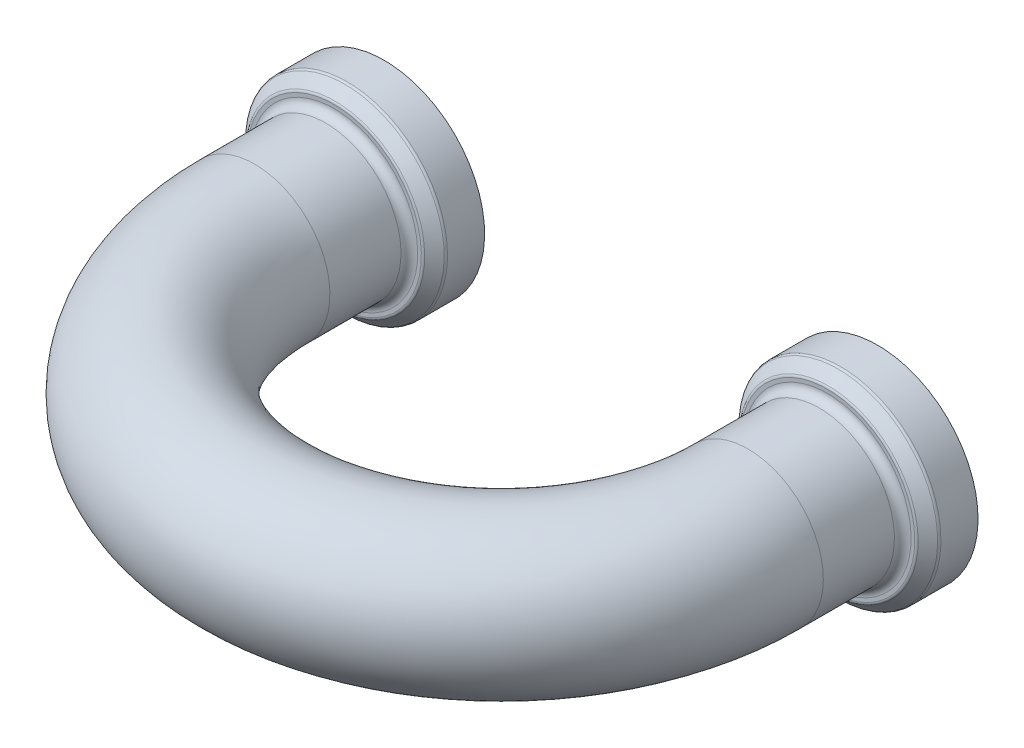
ISO-10303-21;
HEADER;
FILE_DESCRIPTION(('STEP AP214'),'2;1');
FILE_NAME('part.step','',(''),(''),'','','');
FILE_SCHEMA(('AUTOMOTIVE_DESIGN { 1 0 10303 214 1 1 1 1 }'));
ENDSEC;
DATA;
#1=APPLICATION_CONTEXT('core data for automotive mechanical design processes');
#2=APPLICATION_PROTOCOL_DEFINITION('international standard','automotive_design',2000,#1);
#3=PRODUCT_CONTEXT('',#1,'mechanical');
#4=PRODUCT('Part','Part','',(#3));
#5=PRODUCT_RELATED_PRODUCT_CATEGORY('part','',(#4));
#6=PRODUCT_DEFINITION_FORMATION('','',#4);
#7=PRODUCT_DEFINITION_CONTEXT('part definition',#1,'design');
#8=PRODUCT_DEFINITION('design','',#6,#7);
#9=PRODUCT_DEFINITION_SHAPE('','',#8);
#10=(LENGTH_UNIT() NAMED_UNIT(*) SI_UNIT(.MILLI.,.METRE.));
#11=(NAMED_UNIT(*) PLANE_ANGLE_UNIT() SI_UNIT($,.RADIAN.));
#12=(NAMED_UNIT(*) SI_UNIT($,.STERADIAN.) SOLID_ANGLE_UNIT());
#13=UNCERTAINTY_MEASURE_WITH_UNIT(LENGTH_MEASURE(1.E-05),#10,'distance_accuracy_value','');
#14=(GEOMETRIC_REPRESENTATION_CONTEXT(3) GLOBAL_UNCERTAINTY_ASSIGNED_CONTEXT((#13)) GLOBAL_UNIT_ASSIGNED_CONTEXT((#10,
#11,#12)) REPRESENTATION_CONTEXT('',''));
#15=CARTESIAN_POINT('',(0.,0.,0.));
#16=DIRECTION('',(0.,0.,1.));
#17=DIRECTION('',(1.,0.,0.));
#18=AXIS2_PLACEMENT_3D('',#15,#16,#17);
#19=CARTESIAN_POINT('',(14.75,0.,7.75));
#20=DIRECTION('',(0.,1.,0.));
#21=DIRECTION('',(-1.,0.,0.));
#22=AXIS2_PLACEMENT_3D('',#19,#20,#21);
#23=TOROIDAL_SURFACE('',#22,14.75,4.5);
#24=CARTESIAN_POINT('',(0.,0.,7.75));
#25=DIRECTION('',(0.,0.,1.));
#26=DIRECTION('',(0.,1.,0.));
#27=AXIS2_PLACEMENT_3D('',#24,#25,#26);
#28=CIRCLE('',#27,4.5);
#29=CARTESIAN_POINT('',(-4.5,0.,7.75));
#30=VERTEX_POINT('',#29);
#31=EDGE_CURVE('E22',#30,#30,#28,.T.);
#32=CARTESIAN_POINT('',(29.5,0.,7.75));
#33=DIRECTION('',(0.,0.,-1.));
#34=DIRECTION('',(0.,1.,0.));
#35=AXIS2_PLACEMENT_3D('',#32,#33,#34);
#36=CIRCLE('',#35,4.5);
#37=CARTESIAN_POINT('',(34.,0.,7.75));
#38=VERTEX_POINT('',#37);
#39=EDGE_CURVE('E26',#38,#38,#36,.T.);
#40=CARTESIAN_POINT('',(14.75,0.,7.75));
#41=DIRECTION('',(0.,1.,0.));
#42=DIRECTION('',(-1.,0.,0.));
#43=AXIS2_PLACEMENT_3D('',#40,#41,#42);
#44=CIRCLE('',#43,19.25);
#45=EDGE_CURVE('',#30,#38,#44,.T.);
#46=ORIENTED_EDGE('',*,*,#31,.T.);
#47=ORIENTED_EDGE('',*,*,#39,.F.);
#48=ORIENTED_EDGE('',*,*,#45,.T.);
#49=ORIENTED_EDGE('',*,*,#45,.F.);
#50=EDGE_LOOP('',(#46,#48,#47,#49));
#51=FACE_BOUND('',#50,.T.);
#52=ADVANCED_FACE('F12',(#51),#23,.T.);
#53=CARTESIAN_POINT('',(0.,0.,0.));
#54=DIRECTION('',(0.,0.,1.));
#55=DIRECTION('',(0.,-1.,0.));
#56=AXIS2_PLACEMENT_3D('',#53,#54,#55);
#57=PLANE('',#56);
#58=CARTESIAN_POINT('',(0.,0.,0.));
#59=DIRECTION('',(0.,0.,1.));
#60=DIRECTION('',(0.,-1.,0.));
#61=AXIS2_PLACEMENT_3D('',#58,#59,#60);
#62=CIRCLE('',#61,6.);
#63=CARTESIAN_POINT('',(0.,-6.,0.));
#64=VERTEX_POINT('',#63);
#65=EDGE_CURVE('E31',#64,#64,#62,.T.);
#66=ORIENTED_EDGE('',*,*,#65,.F.);
#67=EDGE_LOOP('',(#66));
#68=FACE_BOUND('',#67,.T.);
#69=CARTESIAN_POINT('',(0.,0.,0.));
#70=DIRECTION('',(0.,0.,1.));
#71=DIRECTION('',(0.,-1.,0.));
#72=AXIS2_PLACEMENT_3D('',#69,#70,#71);
#73=CIRCLE('',#72,1.75);
#74=CARTESIAN_POINT('',(0.,-1.75,0.));
#75=VERTEX_POINT('',#74);
#76=EDGE_CURVE('E18',#75,#75,#73,.F.);
#77=ORIENTED_EDGE('',*,*,#76,.F.);
#78=EDGE_LOOP('',(#77));
#79=FACE_BOUND('',#78,.T.);
#80=ADVANCED_FACE('F92',(#68,#79),#57,.F.);
#81=CARTESIAN_POINT('',(0.,0.,7.75));
#82=DIRECTION('',(0.,0.,1.));
#83=DIRECTION('',(0.,-1.,0.));
#84=AXIS2_PLACEMENT_3D('',#81,#82,#83);
#85=CYLINDRICAL_SURFACE('',#84,6.);
#86=CARTESIAN_POINT('',(0.,0.,2.21715728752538));
#87=DIRECTION('',(0.,0.,1.));
#88=DIRECTION('',(0.,-1.,0.));
#89=AXIS2_PLACEMENT_3D('',#86,#87,#88);
#90=CIRCLE('',#89,6.);
#91=CARTESIAN_POINT('',(0.,-6.,2.21715728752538));
#92=VERTEX_POINT('',#91);
#93=EDGE_CURVE('E34',#92,#92,#90,.T.);
#94=ORIENTED_EDGE('',*,*,#93,.F.);
#95=EDGE_LOOP('',(#94));
#96=FACE_BOUND('',#95,.T.);
#97=ORIENTED_EDGE('',*,*,#65,.T.);
#98=EDGE_LOOP('',(#97));
#99=FACE_BOUND('',#98,.T.);
#100=ADVANCED_FACE('F97',(#96,#99),#85,.T.);
#101=CARTESIAN_POINT('',(0.,0.,2.21715728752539));
#102=DIRECTION('',(0.,0.,1.));
#103=DIRECTION('',(0.,-1.,0.));
#104=AXIS2_PLACEMENT_3D('',#101,#102,#103);
#105=TOROIDAL_SURFACE('',#104,5.8,0.199999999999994);
#106=ORIENTED_EDGE('',*,*,#93,.T.);
#107=EDGE_LOOP('',(#106));
#108=FACE_BOUND('',#107,.T.);
#109=CARTESIAN_POINT('',(0.,0.,2.35857864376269));
#110=DIRECTION('',(0.,0.,1.));
#111=DIRECTION('',(0.,-1.,0.));
#112=AXIS2_PLACEMENT_3D('',#109,#110,#111);
#113=CIRCLE('',#112,5.94142135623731);
#114=CARTESIAN_POINT('',(0.,-5.94142135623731,2.35857864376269));
#115=VERTEX_POINT('',#114);
#116=EDGE_CURVE('E37',#115,#115,#113,.T.);
#117=ORIENTED_EDGE('',*,*,#116,.F.);
#118=EDGE_LOOP('',(#117));
#119=FACE_BOUND('',#118,.T.);
#120=ADVANCED_FACE('F164',(#108,#119),#105,.T.);
#121=CARTESIAN_POINT('',(0.,0.,2.35857864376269));
#122=DIRECTION('',(0.,0.,-1.));
#123=DIRECTION('',(0.,1.,0.));
#124=AXIS2_PLACEMENT_3D('',#121,#122,#123);
#125=CONICAL_SURFACE('',#124,5.94142135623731,0.785398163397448);
#126=CARTESIAN_POINT('',(0.,0.,2.94142135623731));
#127=DIRECTION('',(0.,0.,1.));
#128=DIRECTION('',(0.,-1.,0.));
#129=AXIS2_PLACEMENT_3D('',#126,#127,#128);
#130=CIRCLE('',#129,5.35857864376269);
#131=CARTESIAN_POINT('',(0.,-5.35857864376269,2.94142135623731));
#132=VERTEX_POINT('',#131);
#133=EDGE_CURVE('E40',#132,#132,#130,.T.);
#134=ORIENTED_EDGE('',*,*,#133,.F.);
#135=EDGE_LOOP('',(#134));
#136=FACE_BOUND('',#135,.T.);
#137=ORIENTED_EDGE('',*,*,#116,.T.);
#138=EDGE_LOOP('',(#137));
#139=FACE_BOUND('',#138,.T.);
#140=ADVANCED_FACE('F160',(#136,#139),#125,.T.);
#141=CARTESIAN_POINT('',(0.,0.,2.8));
#142=DIRECTION('',(0.,0.,1.));
#143=DIRECTION('',(0.,-1.,0.));
#144=AXIS2_PLACEMENT_3D('',#141,#142,#143);
#145=TOROIDAL_SURFACE('',#144,5.21715728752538,0.199999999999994);
#146=ORIENTED_EDGE('',*,*,#133,.T.);
#147=EDGE_LOOP('',(#146));
#148=FACE_BOUND('',#147,.T.);
#149=CARTESIAN_POINT('',(0.,0.,3.));
#150=DIRECTION('',(0.,0.,1.));
#151=DIRECTION('',(0.,-1.,0.));
#152=AXIS2_PLACEMENT_3D('',#149,#150,#151);
#153=CIRCLE('',#152,5.21715728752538);
#154=CARTESIAN_POINT('',(0.,-5.21715728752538,3.));
#155=VERTEX_POINT('',#154);
#156=EDGE_CURVE('E43',#155,#155,#153,.T.);
#157=ORIENTED_EDGE('',*,*,#156,.F.);
#158=EDGE_LOOP('',(#157));
#159=FACE_BOUND('',#158,.T.);
#160=ADVANCED_FACE('F156',(#148,#159),#145,.T.);
#161=CARTESIAN_POINT('',(-5.21715728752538,0.,3.));
#162=DIRECTION('',(0.,0.,-1.));
#163=DIRECTION('',(0.,1.,0.));
#164=AXIS2_PLACEMENT_3D('',#161,#162,#163);
#165=PLANE('',#164);
#166=CARTESIAN_POINT('',(0.,0.,3.));
#167=DIRECTION('',(0.,0.,1.));
#168=DIRECTION('',(0.,-1.,0.));
#169=AXIS2_PLACEMENT_3D('',#166,#167,#168);
#170=CIRCLE('',#169,5.);
#171=CARTESIAN_POINT('',(0.,-5.,3.));
#172=VERTEX_POINT('',#171);
#173=EDGE_CURVE('E46',#172,#172,#170,.T.);
#174=ORIENTED_EDGE('',*,*,#173,.F.);
#175=EDGE_LOOP('',(#174));
#176=FACE_BOUND('',#175,.T.);
#177=ORIENTED_EDGE('',*,*,#156,.T.);
#178=EDGE_LOOP('',(#177));
#179=FACE_BOUND('',#178,.T.);
#180=ADVANCED_FACE('F152',(#176,#179),#165,.F.);
#181=CARTESIAN_POINT('',(0.,0.,3.5));
#182=DIRECTION('',(0.,0.,1.));
#183=DIRECTION('',(0.,-1.,0.));
#184=AXIS2_PLACEMENT_3D('',#181,#182,#183);
#185=TOROIDAL_SURFACE('',#184,5.,0.5);
#186=CARTESIAN_POINT('',(0.,0.,3.5));
#187=DIRECTION('',(0.,0.,1.));
#188=DIRECTION('',(0.,-1.,0.));
#189=AXIS2_PLACEMENT_3D('',#186,#187,#188);
#190=CIRCLE('',#189,4.5);
#191=CARTESIAN_POINT('',(0.,-4.5,3.5));
#192=VERTEX_POINT('',#191);
#193=EDGE_CURVE('E49',#192,#192,#190,.T.);
#194=ORIENTED_EDGE('',*,*,#193,.F.);
#195=EDGE_LOOP('',(#194));
#196=FACE_BOUND('',#195,.T.);
#197=ORIENTED_EDGE('',*,*,#173,.T.);
#198=EDGE_LOOP('',(#197));
#199=FACE_BOUND('',#198,.T.);
#200=ADVANCED_FACE('F148',(#196,#199),#185,.F.);
#201=CARTESIAN_POINT('',(0.,0.,7.75));
#202=DIRECTION('',(0.,0.,1.));
#203=DIRECTION('',(0.,-1.,0.));
#204=AXIS2_PLACEMENT_3D('',#201,#202,#203);
#205=CYLINDRICAL_SURFACE('',#204,4.5);
#206=ORIENTED_EDGE('',*,*,#31,.F.);
#207=EDGE_LOOP('',(#206));
#208=FACE_BOUND('',#207,.T.);
#209=ORIENTED_EDGE('',*,*,#193,.T.);
#210=EDGE_LOOP('',(#209));
#211=FACE_BOUND('',#210,.T.);
#212=ADVANCED_FACE('F144',(#208,#211),#205,.T.);
#213=CARTESIAN_POINT('',(29.5,0.,0.));
#214=DIRECTION('',(0.,0.,1.));
#215=DIRECTION('',(0.,-1.,0.));
#216=AXIS2_PLACEMENT_3D('',#213,#214,#215);
#217=PLANE('',#216);
#218=CARTESIAN_POINT('',(29.5,0.,0.));
#219=DIRECTION('',(0.,0.,1.));
#220=DIRECTION('',(0.,-1.,0.));
#221=AXIS2_PLACEMENT_3D('',#218,#219,#220);
#222=CIRCLE('',#221,6.);
#223=CARTESIAN_POINT('',(29.5,-6.,0.));
#224=VERTEX_POINT('',#223);
#225=EDGE_CURVE('E52',#224,#224,#222,.T.);
#226=ORIENTED_EDGE('',*,*,#225,.F.);
#227=EDGE_LOOP('',(#226));
#228=FACE_BOUND('',#227,.T.);
#229=CARTESIAN_POINT('',(29.5,0.,0.));
#230=DIRECTION('',(0.,0.,1.));
#231=DIRECTION('',(0.,-1.,0.));
#232=AXIS2_PLACEMENT_3D('',#229,#230,#231);
#233=CIRCLE('',#232,1.75);
#234=CARTESIAN_POINT('',(29.5,-1.75,0.));
#235=VERTEX_POINT('',#234);
#236=EDGE_CURVE('E8',#235,#235,#233,.F.);
#237=ORIENTED_EDGE('',*,*,#236,.F.);
#238=EDGE_LOOP('',(#237));
#239=FACE_BOUND('',#238,.T.);
#240=ADVANCED_FACE('F140',(#228,#239),#217,.F.);
#241=CARTESIAN_POINT('',(29.5,0.,7.75));
#242=DIRECTION('',(0.,0.,1.));
#243=DIRECTION('',(0.,-1.,0.));
#244=AXIS2_PLACEMENT_3D('',#241,#242,#243);
#245=CYLINDRICAL_SURFACE('',#244,6.);
#246=CARTESIAN_POINT('',(29.5,0.,2.21715728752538));
#247=DIRECTION('',(0.,0.,1.));
#248=DIRECTION('',(0.,-1.,0.));
#249=AXIS2_PLACEMENT_3D('',#246,#247,#248);
#250=CIRCLE('',#249,6.);
#251=CARTESIAN_POINT('',(29.5,-6.,2.21715728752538));
#252=VERTEX_POINT('',#251);
#253=EDGE_CURVE('E55',#252,#252,#250,.T.);
#254=ORIENTED_EDGE('',*,*,#253,.F.);
#255=EDGE_LOOP('',(#254));
#256=FACE_BOUND('',#255,.T.);
#257=ORIENTED_EDGE('',*,*,#225,.T.);
#258=EDGE_LOOP('',(#257));
#259=FACE_BOUND('',#258,.T.);
#260=ADVANCED_FACE('F136',(#256,#259),#245,.T.);
#261=CARTESIAN_POINT('',(29.5,0.,2.21715728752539));
#262=DIRECTION('',(0.,0.,1.));
#263=DIRECTION('',(0.,-1.,0.));
#264=AXIS2_PLACEMENT_3D('',#261,#262,#263);
#265=TOROIDAL_SURFACE('',#264,5.8,0.199999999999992);
#266=ORIENTED_EDGE('',*,*,#253,.T.);
#267=EDGE_LOOP('',(#266));
#268=FACE_BOUND('',#267,.T.);
#269=CARTESIAN_POINT('',(29.5,0.,2.35857864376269));
#270=DIRECTION('',(0.,0.,1.));
#271=DIRECTION('',(0.,-1.,0.));
#272=AXIS2_PLACEMENT_3D('',#269,#270,#271);
#273=CIRCLE('',#272,5.94142135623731);
#274=CARTESIAN_POINT('',(29.5,-5.94142135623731,2.35857864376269));
#275=VERTEX_POINT('',#274);
#276=EDGE_CURVE('E58',#275,#275,#273,.T.);
#277=ORIENTED_EDGE('',*,*,#276,.F.);
#278=EDGE_LOOP('',(#277));
#279=FACE_BOUND('',#278,.T.);
#280=ADVANCED_FACE('F130',(#268,#279),#265,.T.);
#281=CARTESIAN_POINT('',(29.5,0.,2.35857864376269));
#282=DIRECTION('',(0.,0.,-1.));
#283=DIRECTION('',(0.,1.,0.));
#284=AXIS2_PLACEMENT_3D('',#281,#282,#283);
#285=CONICAL_SURFACE('',#284,5.94142135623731,0.78539816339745);
#286=CARTESIAN_POINT('',(29.5,0.,2.94142135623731));
#287=DIRECTION('',(0.,0.,1.));
#288=DIRECTION('',(0.,-1.,0.));
#289=AXIS2_PLACEMENT_3D('',#286,#287,#288);
#290=CIRCLE('',#289,5.35857864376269);
#291=CARTESIAN_POINT('',(29.5,-5.35857864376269,2.94142135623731));
#292=VERTEX_POINT('',#291);
#293=EDGE_CURVE('E61',#292,#292,#290,.T.);
#294=ORIENTED_EDGE('',*,*,#293,.F.);
#295=EDGE_LOOP('',(#294));
#296=FACE_BOUND('',#295,.T.);
#297=ORIENTED_EDGE('',*,*,#276,.T.);
#298=EDGE_LOOP('',(#297));
#299=FACE_BOUND('',#298,.T.);
#300=ADVANCED_FACE('F124',(#296,#299),#285,.T.);
#301=CARTESIAN_POINT('',(29.5,0.,2.8));
#302=DIRECTION('',(0.,0.,1.));
#303=DIRECTION('',(0.,-1.,0.));
#304=AXIS2_PLACEMENT_3D('',#301,#302,#303);
#305=TOROIDAL_SURFACE('',#304,5.21715728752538,0.200000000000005);
#306=ORIENTED_EDGE('',*,*,#293,.T.);
#307=EDGE_LOOP('',(#306));
#308=FACE_BOUND('',#307,.T.);
#309=CARTESIAN_POINT('',(29.5,0.,3.));
#310=DIRECTION('',(0.,0.,1.));
#311=DIRECTION('',(0.,-1.,0.));
#312=AXIS2_PLACEMENT_3D('',#309,#310,#311);
#313=CIRCLE('',#312,5.21715728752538);
#314=CARTESIAN_POINT('',(29.5,-5.21715728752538,3.));
#315=VERTEX_POINT('',#314);
#316=EDGE_CURVE('E64',#315,#315,#313,.T.);
#317=ORIENTED_EDGE('',*,*,#316,.F.);
#318=EDGE_LOOP('',(#317));
#319=FACE_BOUND('',#318,.T.);
#320=ADVANCED_FACE('F119',(#308,#319),#305,.T.);
#321=CARTESIAN_POINT('',(24.2828427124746,0.,3.));
#322=DIRECTION('',(0.,0.,-1.));
#323=DIRECTION('',(0.,1.,0.));
#324=AXIS2_PLACEMENT_3D('',#321,#322,#323);
#325=PLANE('',#324);
#326=CARTESIAN_POINT('',(29.5,0.,3.));
#327=DIRECTION('',(0.,0.,1.));
#328=DIRECTION('',(0.,-1.,0.));
#329=AXIS2_PLACEMENT_3D('',#326,#327,#328);
#330=CIRCLE('',#329,5.);
#331=CARTESIAN_POINT('',(29.5,-5.,3.));
#332=VERTEX_POINT('',#331);
#333=EDGE_CURVE('E67',#332,#332,#330,.T.);
#334=ORIENTED_EDGE('',*,*,#333,.F.);
#335=EDGE_LOOP('',(#334));
#336=FACE_BOUND('',#335,.T.);
#337=ORIENTED_EDGE('',*,*,#316,.T.);
#338=EDGE_LOOP('',(#337));
#339=FACE_BOUND('',#338,.T.);
#340=ADVANCED_FACE('F113',(#336,#339),#325,.F.);
#341=CARTESIAN_POINT('',(29.5,0.,3.5));
#342=DIRECTION('',(0.,0.,1.));
#343=DIRECTION('',(0.,-1.,0.));
#344=AXIS2_PLACEMENT_3D('',#341,#342,#343);
#345=TOROIDAL_SURFACE('',#344,5.,0.5);
#346=CARTESIAN_POINT('',(29.5,0.,3.5));
#347=DIRECTION('',(0.,0.,1.));
#348=DIRECTION('',(0.,-1.,0.));
#349=AXIS2_PLACEMENT_3D('',#346,#347,#348);
#350=CIRCLE('',#349,4.5);
#351=CARTESIAN_POINT('',(29.5,-4.5,3.5));
#352=VERTEX_POINT('',#351);
#353=EDGE_CURVE('E70',#352,#352,#350,.T.);
#354=ORIENTED_EDGE('',*,*,#353,.F.);
#355=EDGE_LOOP('',(#354));
#356=FACE_BOUND('',#355,.T.);
#357=ORIENTED_EDGE('',*,*,#333,.T.);
#358=EDGE_LOOP('',(#357));
#359=FACE_BOUND('',#358,.T.);
#360=ADVANCED_FACE('F107',(#356,#359),#345,.F.);
#361=CARTESIAN_POINT('',(29.5,0.,7.75));
#362=DIRECTION('',(0.,0.,1.));
#363=DIRECTION('',(0.,-1.,0.));
#364=AXIS2_PLACEMENT_3D('',#361,#362,#363);
#365=CYLINDRICAL_SURFACE('',#364,4.5);
#366=ORIENTED_EDGE('',*,*,#39,.T.);
#367=EDGE_LOOP('',(#366));
#368=FACE_BOUND('',#367,.T.);
#369=ORIENTED_EDGE('',*,*,#353,.T.);
#370=EDGE_LOOP('',(#369));
#371=FACE_BOUND('',#370,.T.);
#372=ADVANCED_FACE('F103',(#368,#371),#365,.T.);
#373=CARTESIAN_POINT('',(0.,0.,14.));
#374=DIRECTION('',(0.,0.,-1.));
#375=DIRECTION('',(0.,1.,0.));
#376=AXIS2_PLACEMENT_3D('',#373,#374,#375);
#377=PLANE('',#376);
#378=CARTESIAN_POINT('',(0.,0.,14.));
#379=DIRECTION('',(0.,0.,-1.));
#380=DIRECTION('',(0.,1.,0.));
#381=AXIS2_PLACEMENT_3D('',#378,#379,#380);
#382=CIRCLE('',#381,1.26110922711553);
#383=CARTESIAN_POINT('',(0.,1.26110922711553,14.));
#384=VERTEX_POINT('',#383);
#385=EDGE_CURVE('E73',#384,#384,#382,.T.);
#386=ORIENTED_EDGE('',*,*,#385,.T.);
#387=EDGE_LOOP('',(#386));
#388=FACE_BOUND('',#387,.T.);
#389=ADVANCED_FACE('F106',(#388),#377,.T.);
#390=CARTESIAN_POINT('',(0.,0.,14.));
#391=DIRECTION('',(0.,0.,-1.));
#392=DIRECTION('',(0.,1.,0.));
#393=AXIS2_PLACEMENT_3D('',#390,#391,#392);
#394=CONICAL_SURFACE('',#393,1.26110922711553,0.0349065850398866);
#395=ORIENTED_EDGE('',*,*,#76,.T.);
#396=EDGE_LOOP('',(#395));
#397=FACE_BOUND('',#396,.T.);
#398=ORIENTED_EDGE('',*,*,#385,.F.);
#399=EDGE_LOOP('',(#398));
#400=FACE_BOUND('',#399,.T.);
#401=ADVANCED_FACE('F89',(#397,#400),#394,.F.);
#402=CARTESIAN_POINT('',(29.5,0.,14.));
#403=DIRECTION('',(0.,0.,-1.));
#404=DIRECTION('',(0.,1.,0.));
#405=AXIS2_PLACEMENT_3D('',#402,#403,#404);
#406=PLANE('',#405);
#407=CARTESIAN_POINT('',(29.5,0.,14.));
#408=DIRECTION('',(0.,0.,-1.));
#409=DIRECTION('',(0.,1.,0.));
#410=AXIS2_PLACEMENT_3D('',#407,#408,#409);
#411=CIRCLE('',#410,1.26110922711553);
#412=CARTESIAN_POINT('',(29.5,1.26110922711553,14.));
#413=VERTEX_POINT('',#412);
#414=EDGE_CURVE('E76',#413,#413,#411,.T.);
#415=ORIENTED_EDGE('',*,*,#414,.T.);
#416=EDGE_LOOP('',(#415));
#417=FACE_BOUND('',#416,.T.);
#418=ADVANCED_FACE('F80',(#417),#406,.T.);
#419=CARTESIAN_POINT('',(29.5,0.,14.));
#420=DIRECTION('',(0.,0.,-1.));
#421=DIRECTION('',(0.,1.,0.));
#422=AXIS2_PLACEMENT_3D('',#419,#420,#421);
#423=CONICAL_SURFACE('',#422,1.26110922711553,0.0349065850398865);
#424=ORIENTED_EDGE('',*,*,#236,.T.);
#425=EDGE_LOOP('',(#424));
#426=FACE_BOUND('',#425,.T.);
#427=ORIENTED_EDGE('',*,*,#414,.F.);
#428=EDGE_LOOP('',(#427));
#429=FACE_BOUND('',#428,.T.);
#430=ADVANCED_FACE('F82',(#426,#429),#423,.F.);
#431=CLOSED_SHELL('',(#52,#80,#100,#120,#140,#160,#180,#200,#212,#240,#260,#280,#300,#320,#340,
#360,#372,#389,#401,#418,#430));
#432=MANIFOLD_SOLID_BREP('B1',#431);
#433=ADVANCED_BREP_SHAPE_REPRESENTATION('',(#18,#432),#14);
#434=SHAPE_DEFINITION_REPRESENTATION(#9,#433);
ENDSEC;
END-ISO-10303-21;
